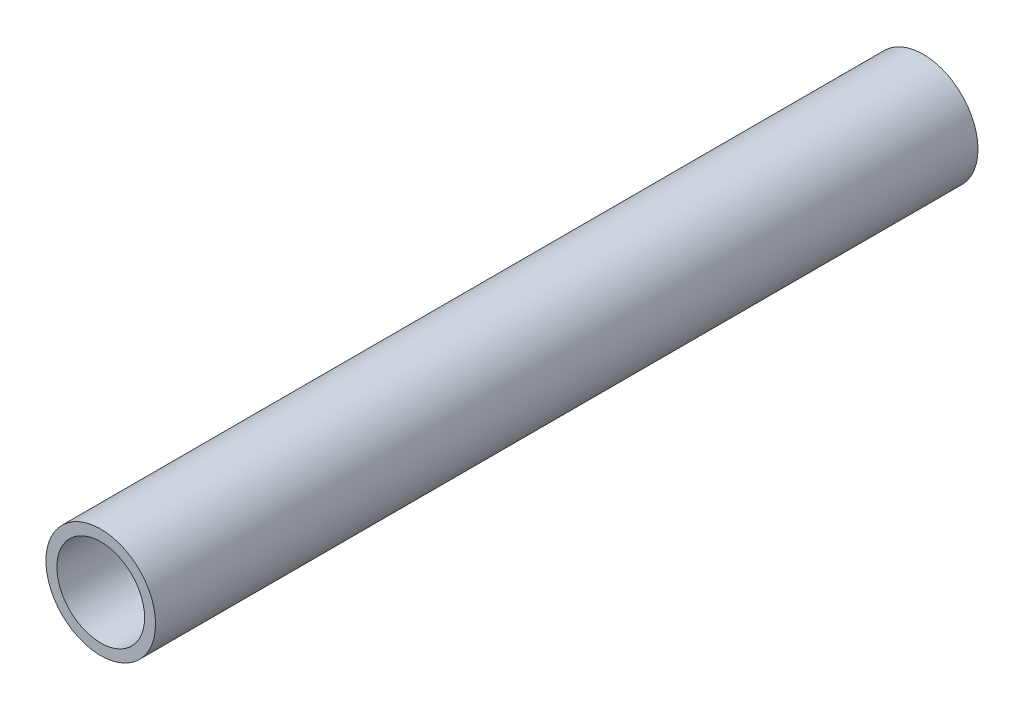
ISO-10303-21;
HEADER;
FILE_DESCRIPTION(('STEP AP214'),'2;1');
FILE_NAME('part.step','',(''),(''),'','','');
FILE_SCHEMA(('AUTOMOTIVE_DESIGN { 1 0 10303 214 1 1 1 1 }'));
ENDSEC;
DATA;
#1=APPLICATION_CONTEXT('core data for automotive mechanical design processes');
#2=APPLICATION_PROTOCOL_DEFINITION('international standard','automotive_design',2000,#1);
#3=PRODUCT_CONTEXT('',#1,'mechanical');
#4=PRODUCT('Part','Part','',(#3));
#5=PRODUCT_RELATED_PRODUCT_CATEGORY('part','',(#4));
#6=PRODUCT_DEFINITION_FORMATION('','',#4);
#7=PRODUCT_DEFINITION_CONTEXT('part definition',#1,'design');
#8=PRODUCT_DEFINITION('design','',#6,#7);
#9=PRODUCT_DEFINITION_SHAPE('','',#8);
#10=(LENGTH_UNIT() NAMED_UNIT(*) SI_UNIT(.MILLI.,.METRE.));
#11=(NAMED_UNIT(*) PLANE_ANGLE_UNIT() SI_UNIT($,.RADIAN.));
#12=(NAMED_UNIT(*) SI_UNIT($,.STERADIAN.) SOLID_ANGLE_UNIT());
#13=UNCERTAINTY_MEASURE_WITH_UNIT(LENGTH_MEASURE(1.E-05),#10,'distance_accuracy_value','');
#14=(GEOMETRIC_REPRESENTATION_CONTEXT(3) GLOBAL_UNCERTAINTY_ASSIGNED_CONTEXT((#13)) GLOBAL_UNIT_ASSIGNED_CONTEXT((#10,
#11,#12)) REPRESENTATION_CONTEXT('',''));
#15=CARTESIAN_POINT('',(0.,0.,0.));
#16=DIRECTION('',(0.,0.,1.));
#17=DIRECTION('',(1.,0.,0.));
#18=AXIS2_PLACEMENT_3D('',#15,#16,#17);
#19=CARTESIAN_POINT('',(0.,0.,150.));
#20=DIRECTION('',(0.,0.,1.));
#21=DIRECTION('',(1.,0.,0.));
#22=AXIS2_PLACEMENT_3D('',#19,#20,#21);
#23=PLANE('',#22);
#24=CARTESIAN_POINT('',(0.,0.,150.));
#25=DIRECTION('',(0.,0.,1.));
#26=DIRECTION('',(1.,0.,0.));
#27=AXIS2_PLACEMENT_3D('',#24,#25,#26);
#28=CIRCLE('',#27,10.);
#29=CARTESIAN_POINT('',(10.,0.,150.));
#30=VERTEX_POINT('',#29);
#31=EDGE_CURVE('E10',#30,#30,#28,.T.);
#32=ORIENTED_EDGE('',*,*,#31,.T.);
#33=EDGE_LOOP('',(#32));
#34=FACE_BOUND('',#33,.T.);
#35=CARTESIAN_POINT('',(0.,0.,150.));
#36=DIRECTION('',(0.,0.,1.));
#37=DIRECTION('',(1.,0.,0.));
#38=AXIS2_PLACEMENT_3D('',#35,#36,#37);
#39=CIRCLE('',#38,8.);
#40=CARTESIAN_POINT('',(8.,0.,150.));
#41=VERTEX_POINT('',#40);
#42=EDGE_CURVE('E42',#41,#41,#39,.T.);
#43=ORIENTED_EDGE('',*,*,#42,.F.);
#44=EDGE_LOOP('',(#43));
#45=FACE_BOUND('',#44,.T.);
#46=ADVANCED_FACE('F31',(#34,#45),#23,.T.);
#47=CARTESIAN_POINT('',(0.,0.,0.));
#48=DIRECTION('',(0.,0.,1.));
#49=DIRECTION('',(1.,0.,0.));
#50=AXIS2_PLACEMENT_3D('',#47,#48,#49);
#51=PLANE('',#50);
#52=CARTESIAN_POINT('',(0.,0.,0.));
#53=DIRECTION('',(0.,0.,1.));
#54=DIRECTION('',(1.,0.,0.));
#55=AXIS2_PLACEMENT_3D('',#52,#53,#54);
#56=CIRCLE('',#55,10.);
#57=CARTESIAN_POINT('',(10.,0.,0.));
#58=VERTEX_POINT('',#57);
#59=EDGE_CURVE('E38',#58,#58,#56,.T.);
#60=ORIENTED_EDGE('',*,*,#59,.F.);
#61=EDGE_LOOP('',(#60));
#62=FACE_BOUND('',#61,.T.);
#63=CARTESIAN_POINT('',(0.,0.,0.));
#64=DIRECTION('',(0.,0.,1.));
#65=DIRECTION('',(1.,0.,0.));
#66=AXIS2_PLACEMENT_3D('',#63,#64,#65);
#67=CIRCLE('',#66,8.);
#68=CARTESIAN_POINT('',(8.,0.,0.));
#69=VERTEX_POINT('',#68);
#70=EDGE_CURVE('E46',#69,#69,#67,.T.);
#71=ORIENTED_EDGE('',*,*,#70,.T.);
#72=EDGE_LOOP('',(#71));
#73=FACE_BOUND('',#72,.T.);
#74=ADVANCED_FACE('F52',(#62,#73),#51,.F.);
#75=CARTESIAN_POINT('',(0.,0.,150.));
#76=DIRECTION('',(0.,0.,-1.));
#77=DIRECTION('',(-1.,0.,0.));
#78=AXIS2_PLACEMENT_3D('',#75,#76,#77);
#79=CYLINDRICAL_SURFACE('',#78,10.);
#80=ORIENTED_EDGE('',*,*,#31,.F.);
#81=EDGE_LOOP('',(#80));
#82=FACE_BOUND('',#81,.T.);
#83=ORIENTED_EDGE('',*,*,#59,.T.);
#84=EDGE_LOOP('',(#83));
#85=FACE_BOUND('',#84,.T.);
#86=ADVANCED_FACE('F33',(#82,#85),#79,.T.);
#87=CARTESIAN_POINT('',(0.,0.,150.));
#88=DIRECTION('',(0.,0.,-1.));
#89=DIRECTION('',(-1.,0.,0.));
#90=AXIS2_PLACEMENT_3D('',#87,#88,#89);
#91=CYLINDRICAL_SURFACE('',#90,8.);
#92=ORIENTED_EDGE('',*,*,#42,.T.);
#93=EDGE_LOOP('',(#92));
#94=FACE_BOUND('',#93,.T.);
#95=ORIENTED_EDGE('',*,*,#70,.F.);
#96=EDGE_LOOP('',(#95));
#97=FACE_BOUND('',#96,.T.);
#98=ADVANCED_FACE('F54',(#94,#97),#91,.F.);
#99=CLOSED_SHELL('',(#46,#74,#86,#98));
#100=MANIFOLD_SOLID_BREP('B2',#99);
#101=ADVANCED_BREP_SHAPE_REPRESENTATION('',(#18,#100),#14);
#102=SHAPE_DEFINITION_REPRESENTATION(#9,#101);
ENDSEC;
END-ISO-10303-21;
